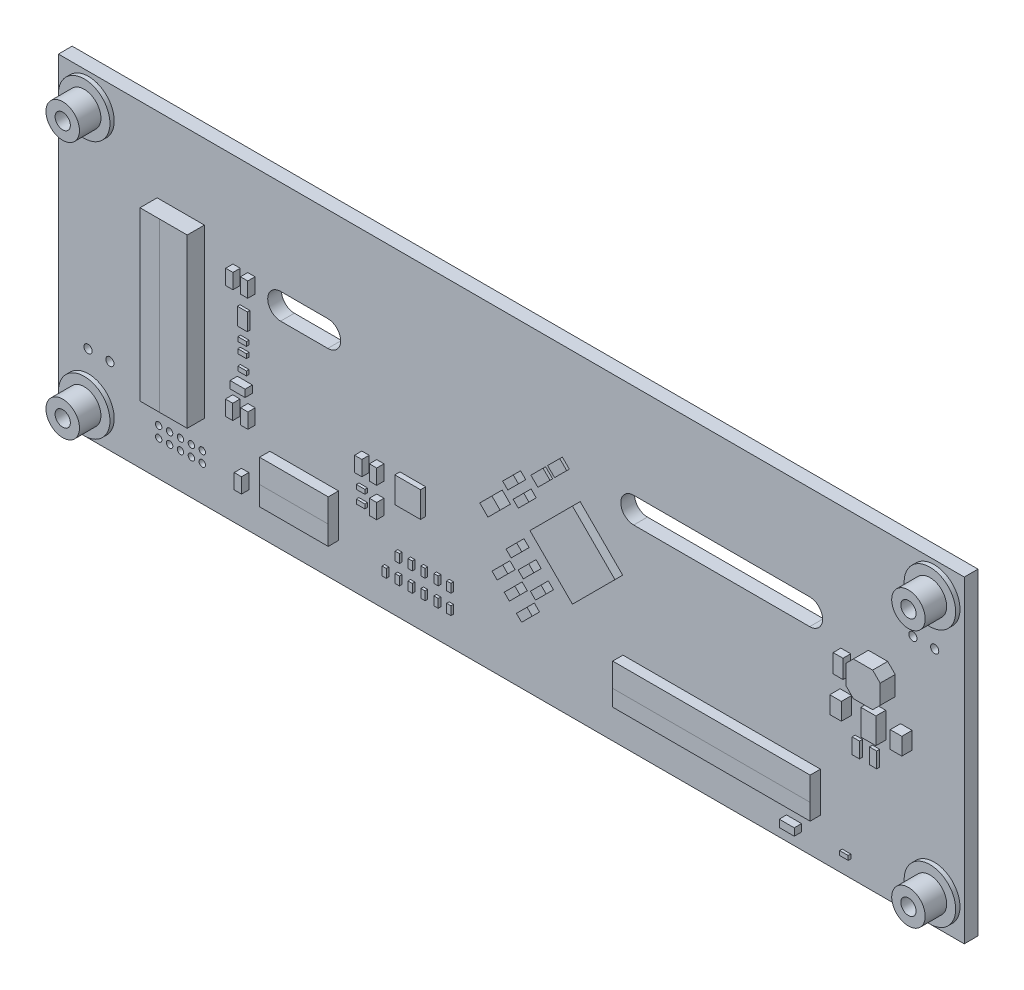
from build123d import *

# Parameters (mm, degrees)
SKETCH1_W                           = 105.5
SKETCH1_H                           = 37
SKETCH1_R                           = 3
PCB_DEPTH                           = 1.6
SKETCH1_3_R                         = 3
SKETCH1_3_R_2                       = 1.95
STANDOFF_BASE_DEPTH                 = 2.1
SKETCH1_4_R                         = 1.95
STANDOFF_DEPTH                      = 4.6
SKETCH2_W                           = 23
SKETCH2_H                           = 4.65
F_50_PIN_J_LCD_DEPTH                = 1.2
SKETCH2_3_W                         = 8
SKETCH2_3_H                         = 5
F_10_PIN_J_CTP_DEPTH                = 1.2
SKETCH2_4_W                         = 5.5
SKETCH2_4_H                         = 19.5
F_30_PIN_J_HOST_DEPTH               = 2
SKETCH4_W                           = 0.85
SKETCH4_H                           = 1.75
SKETCH4_W_2                         = 1.75
SKETCH4_H_2                         = 0.85
SMALL_CAPS_DEPTH                    = 0.85
SKETCH5_W                           = 1
SKETCH5_H                           = 0.5
SKETCH5_W_2                         = 0.5
SKETCH5_H_2                         = 1
SMALL_RESISTORS_DEPTH               = 0.3
SKETCH6_W                           = 1.35
SKETCH6_H                           = 2
BIG_CAPS_DEPTH                      = 1.2
SKETCH7_W                           = 0.85
SKETCH7_H                           = 1.8
BIG_RESISTORS_DEPTH                 = 0.35
SKETCH8_W                           = 1.15
SKETCH8_H                           = 2
RA1_3_DEPTH                         = 0.3
EXTRUDE_U1_DEPTH                    = 0.9
SKETCH8_5_W                         = 1.75
SKETCH8_5_H                         = 3
EXTRUDE_U2_DEPTH                    = 1.15
SKETCH8_4_W                         = 3
SKETCH8_4_H                         = 3
EXTRUDE_U3_DEPTH                    = 0.6
SKETCH8_6_W                         = 1.15
SKETCH8_6_H                         = 2.15
EXTRUDE_D1_DEPTH                    = 0.9
EXTRUDE_L1_DEPTH                    = 1.75
SKETCH9_R                           = 0.475
SKETCH9_R_2                         = 0.375
GND_AND_JPROG_HOLES_DEPTH           = 56.980465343
F_2_56_TAPPED_HOLE1_D               = 1.778
F_2_56_TAPPED_HOLE1_DEPTH           = 3.5
F_2_56_TAPPED_HOLE1_TIP             = 0.53416509
F_2_56_TAPPED_HOLE1_ON_FACE_2_D     = 1.778
F_2_56_TAPPED_HOLE1_ON_FACE_2_DEPTH = 3.5
F_2_56_TAPPED_HOLE1_ON_FACE_2_TIP   = 0.53416509


with BuildPart() as part:
    # Sketch1 → PCB (new body)
    with BuildSketch(Plane.XY):
        Rectangle(SKETCH1_W, SKETCH1_H)
        with Locations((-49.25, -15)):
            Circle(SKETCH1_R, mode=Mode.SUBTRACT)
        with Locations((49.25, -15)):
            Circle(SKETCH1_R, mode=Mode.SUBTRACT)
        with Locations((49.25, 15)):
            Circle(SKETCH1_R, mode=Mode.SUBTRACT)
        with Locations((-49.25, 15)):
            Circle(SKETCH1_R, mode=Mode.SUBTRACT)
        with BuildLine():
            ThreePointArc((34.75, 4.5), (36.25, 6), (34.75, 7.5))
            Line((34.75, 7.5), (14.25, 7.5))
            ThreePointArc((14.25, 7.5), (12.75, 6), (14.25, 4.5))
            Line((14.25, 4.5), (34.75, 4.5))
        make_face(mode=Mode.SUBTRACT)
        with BuildLine():
            ThreePointArc((-21.375, 4.5), (-19.875, 6), (-21.375, 7.5))
            Line((-21.375, 7.5), (-26.875, 7.5))
            ThreePointArc((-26.875, 7.5), (-28.375, 6), (-26.875, 4.5))
            Line((-26.875, 4.5), (-21.375, 4.5))
        make_face(mode=Mode.SUBTRACT)
    extrude(amount=PCB_DEPTH)

    # Sketch1_3 → Standoff Base (add)
    # profile 1 of 4: a face of its own
    with BuildSketch(Plane.XY):
        with Locations((-49.25, 15)):
            Circle(SKETCH1_3_R)
        with Locations((-49.25, 15)):
            Circle(SKETCH1_3_R_2, mode=Mode.SUBTRACT)
    # profile 2 of 4: a face of its own
    with BuildSketch(Plane.XY):
        with Locations((-49.25, -15)):
            Circle(SKETCH1_3_R)
        with Locations((-49.25, -15)):
            Circle(SKETCH1_3_R_2, mode=Mode.SUBTRACT)
    # profile 3 of 4: a face of its own
    with BuildSketch(Plane.XY):
        with Locations((49.25, 15)):
            Circle(SKETCH1_3_R)
        with Locations((49.25, 15)):
            Circle(SKETCH1_3_R_2, mode=Mode.SUBTRACT)
    # profile 4 of 4: a face of its own
    with BuildSketch(Plane.XY):
        with Locations((49.25, -15)):
            Circle(SKETCH1_3_R)
        with Locations((49.25, -15)):
            Circle(SKETCH1_3_R_2, mode=Mode.SUBTRACT)
    extrude(amount=STANDOFF_BASE_DEPTH)

    # Sketch1_4 → Standoff (add)
    with BuildSketch(Plane.XY):
        with Locations((-49.25, 15)):
            Circle(SKETCH1_4_R)
        with Locations((-49.25, -15)):
            Circle(SKETCH1_4_R)
        with Locations((49.25, 15)):
            Circle(SKETCH1_4_R)
        with Locations((49.25, -15)):
            Circle(SKETCH1_4_R)
    extrude(amount=STANDOFF_DEPTH)

    # Sketch2 → 50 Pin J_LCD (add)
    with BuildSketch(Plane.XY.offset(1.6)):
        with Locations((24.5, -11.575)):
            Rectangle(SKETCH2_W, SKETCH2_H)
    extrude(amount=F_50_PIN_J_LCD_DEPTH)

    # Sketch2_3 → 10 Pin J_CTP (add)
    with BuildSketch(Plane.XY.offset(1.6)):
        with Locations((-24.125, -11.75)):
            Rectangle(SKETCH2_3_W, SKETCH2_3_H)
    extrude(amount=F_10_PIN_J_CTP_DEPTH)

    # Sketch2_4 → 30 Pin J_HOST (add)
    with BuildSketch(Plane.XY.offset(1.6)):
        with Locations((-38.5, 0)):
            Rectangle(SKETCH2_4_W, SKETCH2_4_H)
    extrude(amount=F_30_PIN_J_HOST_DEPTH)

    # Sketch4 → Small Caps (add)
    with BuildSketch(Plane.XY.offset(1.6)):
        with Locations((-30.277297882, 6.612048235)):
            Rectangle(SKETCH4_W, SKETCH4_H)
        with Locations((-32.000447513, 6.612048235)):
            Rectangle(SKETCH4_W, SKETCH4_H)
        with Locations((-32.023637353, -6.590874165)):
            Rectangle(SKETCH4_W, SKETCH4_H)
        with Locations((-30.254262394, -6.590874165)):
            Rectangle(SKETCH4_W, SKETCH4_H)
        with Locations((-31.034139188, -4.003363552)):
            Rectangle(SKETCH4_W_2, SKETCH4_H_2)
        Polygon((1.074504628, 3.385055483), (1.675621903, 2.78409124), (0.438185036, 1.546654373), (-0.162932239, 2.147618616), align=None)
        Polygon((2.298191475, 2.161680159), (2.89930875, 1.560715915), (1.661871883, 0.323279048), (1.060754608, 0.924243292), align=None)
        Polygon((1.467720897, -3.268848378), (2.068838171, -3.869812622), (0.831401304, -5.107249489), (0.23028403, -4.506285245), align=None)
        Polygon((2.877563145, -4.678331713), (3.478680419, -5.279295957), (2.241243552, -6.516732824), (1.640126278, -5.91576858), align=None)
        Polygon((4.305625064, -6.10603008), (4.906742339, -6.706994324), (3.669305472, -7.944431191), (3.068188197, -7.343466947), align=None)
        Polygon((-0.162247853, -6.311722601), (0.438869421, -6.912686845), (-0.798567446, -8.150123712), (-1.399684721, -7.549159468), align=None)
        Polygon((1.256994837, -7.730603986), (1.858112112, -8.331568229), (0.620675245, -9.569005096), (0.01955797, -8.968040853), align=None)
        Polygon((2.680752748, -9.15399944), (3.281870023, -9.754963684), (2.044433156, -10.992400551), (1.443315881, -10.391436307), align=None)
        with Locations((-16.985196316, -4.744812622)):
            Rectangle(SKETCH4_W, SKETCH4_H)
        with Locations((-15.257966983, -4.744812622)):
            Rectangle(SKETCH4_W, SKETCH4_H)
        with Locations((-15.257966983, -8.218466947)):
            Rectangle(SKETCH4_W, SKETCH4_H)
        with Locations((-31.007390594, -13.500477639)):
            Rectangle(SKETCH4_W, SKETCH4_H)
        with Locations((32.927467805, -16.266755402)):
            Rectangle(SKETCH4_W_2, SKETCH4_H_2)
    extrude(amount=SMALL_CAPS_DEPTH)

    # Sketch5 → Small Resistors (add)
    with BuildSketch(Plane.XY.offset(1.6)):
        with Locations((-31.053539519, -0.727896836)):
            Rectangle(SKETCH5_W, SKETCH5_H)
        with Locations((-31.053539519, 0.501817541)):
            Rectangle(SKETCH5_W, SKETCH5_H)
        with Locations((-31.053539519, -2.469114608)):
            Rectangle(SKETCH5_W, SKETCH5_H)
        with Locations((-17.257797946, -7.510191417)):
            Rectangle(SKETCH5_W, SKETCH5_H)
        with Locations((-17.257797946, -8.986514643)):
            Rectangle(SKETCH5_W, SKETCH5_H)
        with Locations((-12.982469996, -12.226832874)):
            Rectangle(SKETCH5_W_2, SKETCH5_H_2)
        with Locations((-11.489854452, -12.226832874)):
            Rectangle(SKETCH5_W_2, SKETCH5_H_2)
        with Locations((-9.996081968, -12.226832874)):
            Rectangle(SKETCH5_W_2, SKETCH5_H_2)
        with Locations((-8.469663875, -12.226832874)):
            Rectangle(SKETCH5_W_2, SKETCH5_H_2)
        with Locations((-6.987597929, -12.226832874)):
            Rectangle(SKETCH5_W_2, SKETCH5_H_2)
        with Locations((-6.987597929, -14.491841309)):
            Rectangle(SKETCH5_W_2, SKETCH5_H_2)
        with Locations((-8.469663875, -14.491841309)):
            Rectangle(SKETCH5_W_2, SKETCH5_H_2)
        with Locations((-9.996081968, -14.491841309)):
            Rectangle(SKETCH5_W_2, SKETCH5_H_2)
        with Locations((-11.489854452, -14.491841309)):
            Rectangle(SKETCH5_W_2, SKETCH5_H_2)
        with Locations((-12.982469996, -14.491841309)):
            Rectangle(SKETCH5_W_2, SKETCH5_H_2)
        with Locations((-14.514472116, -14.491841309)):
            Rectangle(SKETCH5_W_2, SKETCH5_H_2)
        with Locations((39.036427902, -16.293646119)):
            Rectangle(SKETCH5_W, SKETCH5_H)
    extrude(amount=SMALL_RESISTORS_DEPTH)

    # Sketch6 → Big Caps (add)
    with BuildSketch(Plane.XY.offset(1.6)):
        with Locations((46.002443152, -1)):
            Rectangle(SKETCH6_W, SKETCH6_H)
        with Locations((38.961363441, -1)):
            Rectangle(SKETCH6_W, SKETCH6_H)
        Polygon((-1.06182133, 0.373221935), (-0.107227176, -0.581372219), (-1.521440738, -1.995585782), (-2.476034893, -1.040991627), align=None)
    extrude(amount=BIG_CAPS_DEPTH)

    # Sketch7 → Big Resistors (add)
    with BuildSketch(Plane.XY.offset(1.6)):
        with Locations((42.477228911, -4.698814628)):
            Rectangle(SKETCH7_W, SKETCH7_H)
        with Locations((40.468546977, -4.698814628)):
            Rectangle(SKETCH7_W, SKETCH7_H)
    extrude(amount=BIG_RESISTORS_DEPTH)

    # Sketch8 → RA1-3 (add)
    with BuildSketch(Plane.XY.offset(1.6)):
        with Locations((-31.029883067, 2.789804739)):
            Rectangle(SKETCH8_W, SKETCH8_H)
        Polygon((3.991669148, 5.249671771), (4.804841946, 4.436498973), (3.390628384, 3.022285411), (2.577455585, 3.835458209), align=None)
        Polygon((4.524295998, 5.782298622), (5.938509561, 7.196512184), (6.751682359, 6.383339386), (5.337468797, 4.969125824), align=None)
    extrude(amount=RA1_3_DEPTH)

    # Sketch8_3 → Extrude U1 (add)
    with BuildSketch(Plane.XY.offset(1.6)):
        Polygon((8.017585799, -6.153537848), (12.967333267, -1.20379038), (8.016955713, 3.745326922), (3.067208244, -1.204420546), align=None)
    extrude(amount=EXTRUDE_U1_DEPTH)

    # Sketch8_5 → Extrude U2 (add)
    with BuildSketch(Plane.XY.offset(1.6)):
        with Locations((42.733281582, -1.008587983)):
            Rectangle(SKETCH8_5_W, SKETCH8_5_H)
    extrude(amount=EXTRUDE_U2_DEPTH)

    # Sketch8_4 → Extrude U3 (add)
    with BuildSketch(Plane.XY.offset(1.6)):
        with Locations((-11.475488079, -5.255639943)):
            Rectangle(SKETCH8_4_W, SKETCH8_4_H)
    extrude(amount=EXTRUDE_U3_DEPTH)

    # Sketch8_6 → Extrude D1 (add)
    with BuildSketch(Plane.XY.offset(1.6)):
        with Locations((38.953356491, 3.072983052)):
            Rectangle(SKETCH8_6_W, SKETCH8_6_H)
    extrude(amount=EXTRUDE_D1_DEPTH)

    # Sketch8_7 → Extrude L1 (add)
    with BuildSketch(Plane.XY.offset(1.6)):
        Polygon((40.707496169, 2.408973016), (41.585962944, 1.530506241), (43.829029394, 1.530506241), (44.707496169, 2.408973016), (44.707496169, 4.652039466), (43.829029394, 5.530506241), (41.585962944, 5.530506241), (40.707496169, 4.652039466), align=None)
    extrude(amount=EXTRUDE_L1_DEPTH)

    # Sketch9 → GND and JPROG holes (cut, through all)
    with BuildSketch(Plane.XY.offset(1.6)):
        with Locations((-49.300930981, -9.514658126)):
            Circle(SKETCH9_R)
        with Locations((-41.074865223, -13.132207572)):
            Circle(SKETCH9_R_2)
        with Locations((-46.75488196, -9.512579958)):
            Circle(SKETCH9_R)
        with Locations((46.772273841, 9.52560079)):
            Circle(SKETCH9_R)
        with Locations((49.306410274, 9.52560079)):
            Circle(SKETCH9_R)
        with Locations((-39.804865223, -13.132207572)):
            Circle(SKETCH9_R_2)
        with Locations((-38.534865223, -13.132207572)):
            Circle(SKETCH9_R_2)
        with Locations((-37.264865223, -13.132207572)):
            Circle(SKETCH9_R_2)
        with Locations((-35.994865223, -13.132207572)):
            Circle(SKETCH9_R_2)
        with Locations((-39.804865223, -14.402207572)):
            Circle(SKETCH9_R_2)
        with Locations((-38.534865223, -14.402207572)):
            Circle(SKETCH9_R_2)
        with Locations((-37.264865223, -14.402207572)):
            Circle(SKETCH9_R_2)
        with Locations((-35.994865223, -14.402207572)):
            Circle(SKETCH9_R_2)
        with Locations((-41.074865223, -14.402207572)):
            Circle(SKETCH9_R_2)
    extrude(amount=-GND_AND_JPROG_HOLES_DEPTH, mode=Mode.SUBTRACT)

    # 2-56 Tapped Hole1
    with Locations(Plane(origin=(-49.25, 15, 4.6), x_dir=(1, 0, 0), z_dir=(0, 0, 1))):
        with Locations((0, 0), (0, -30), (98.5, 0), (98.5, -30)):
            Hole(F_2_56_TAPPED_HOLE1_D / 2, depth=F_2_56_TAPPED_HOLE1_DEPTH)
            with Locations((0, 0, -(F_2_56_TAPPED_HOLE1_DEPTH + F_2_56_TAPPED_HOLE1_TIP / 2))):  # 118° drill point
                Cone(0, F_2_56_TAPPED_HOLE1_D / 2, F_2_56_TAPPED_HOLE1_TIP, mode=Mode.SUBTRACT)

    # 2-56 Tapped Hole1 on face 2
    with Locations(Plane(origin=(-61.166543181, 17.788379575, 0), x_dir=(1, 0, 0), z_dir=(0, 0, 1))):
        with Locations((0, 0)):
            Hole(F_2_56_TAPPED_HOLE1_ON_FACE_2_D / 2, depth=F_2_56_TAPPED_HOLE1_ON_FACE_2_DEPTH)
            with Locations((0, 0, -(F_2_56_TAPPED_HOLE1_ON_FACE_2_DEPTH + F_2_56_TAPPED_HOLE1_ON_FACE_2_TIP / 2))):  # 118° drill point
                Cone(0, F_2_56_TAPPED_HOLE1_ON_FACE_2_D / 2, F_2_56_TAPPED_HOLE1_ON_FACE_2_TIP, mode=Mode.SUBTRACT)


solid = part.part
